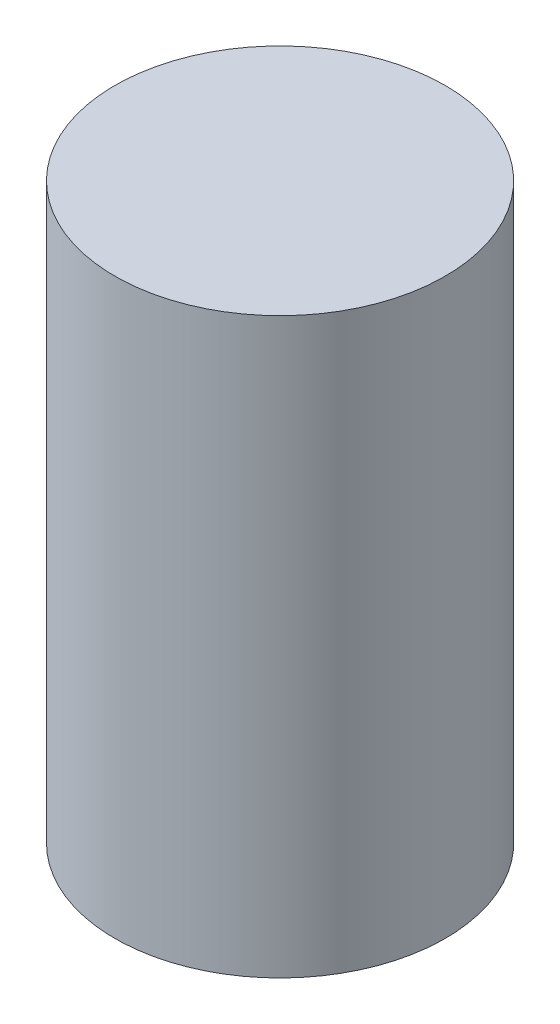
from build123d import *

# Parameters (mm, degrees)
BOSS_EXTRUDE1_DEPTH = 11.938
BOSS_EXTRUDE2_START = 10.3632
SKETCH2_R           = 2.9845
BOSS_EXTRUDE2_DEPTH = 10.3632
SKETCH3_W           = 14.311067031
SKETCH3_H           = 13.349519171
CUT_EXTRUDE1_DEPTH  = 14.092271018


with BuildPart() as part:
    # Sketch1 → Boss-Extrude1 (new body)
    with BuildSketch(Plane(origin=(0, 0, 0), x_dir=(1, 0, 0), z_dir=(0, 1, 0))):
        with BuildLine():
            Line((-2.588308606, 1.4859), (2.588308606, 1.4859))
            ThreePointArc((2.588308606, 1.4859), (0, -2.9845), (-2.588308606, 1.4859))
        make_face()
    extrude(amount=BOSS_EXTRUDE1_DEPTH)

    # Sketch2 → Boss-Extrude2 (add)
    with BuildSketch(Plane.XZ.offset(BOSS_EXTRUDE2_START)):
        with Locations(Location((0, 0, 0), (0, 0, 270))):
            Circle(SKETCH2_R)
    extrude(amount=-BOSS_EXTRUDE2_DEPTH)

    # Sketch3 → Cut-Extrude1 (cut, through all)
    with BuildSketch(Plane(origin=(0, 0, -1.4859), x_dir=(-1, 0, 0), z_dir=(0, 0, -1))):
        with Locations((0.41254287, 6.674759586)):
            Rectangle(SKETCH3_W, SKETCH3_H)
    extrude(amount=-CUT_EXTRUDE1_DEPTH, mode=Mode.SUBTRACT)

    # Sketch6 → Cut-Revolve6 (revolve, cut)
    with BuildSketch(Plane(origin=(0, -3.048, 0), x_dir=(1, 0, 0), z_dir=(0, 1, 0))):
        Polygon((-2.401657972, 3.832461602), (0, 3.832461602), (0, 1.43080363), align=None)
    revolve(axis=Axis((0, -3.048, 0), (0, 0, -1)), mode=Mode.SUBTRACT)


solid = part.part
